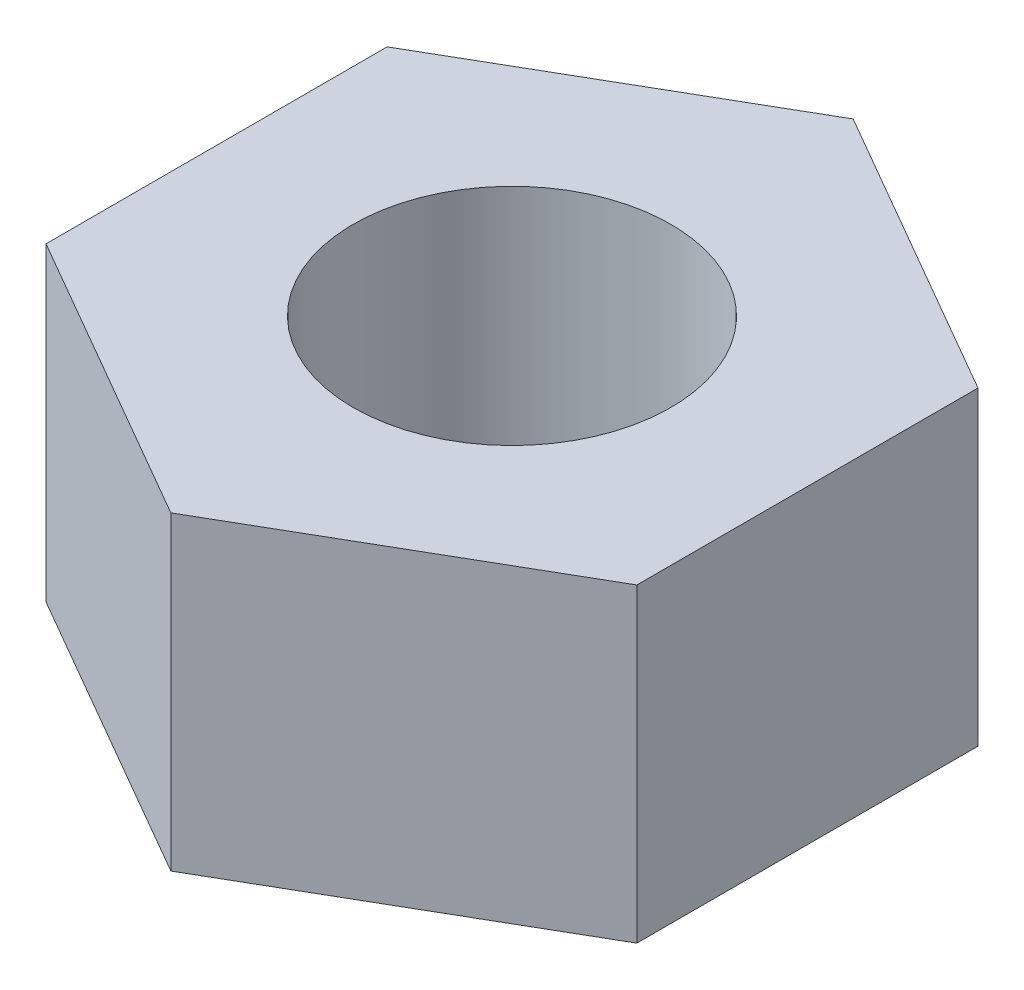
from build123d import *

# Parameters (mm, degrees)
SKETCH1_R           = 2.7305
BOSS_EXTRUDE1_DEPTH = 5.334


with BuildPart() as part:
    # Sketch1 → Boss-Extrude1 (new body)
    with BuildSketch(Plane(origin=(0, 0, 0), x_dir=(1, 0, 0), z_dir=(0, 1, 0))):
        Polygon((0, 5.865878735), (-5.08, 2.932939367), (-5.08, -2.932939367), (0, -5.865878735), (5.08, -2.932939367), (5.08, 2.932939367), align=None)
        with Locations(Location((0, 0, 0), (0, 0, 270))):
            Circle(SKETCH1_R, mode=Mode.SUBTRACT)
    extrude(amount=BOSS_EXTRUDE1_DEPTH)


solid = part.part
